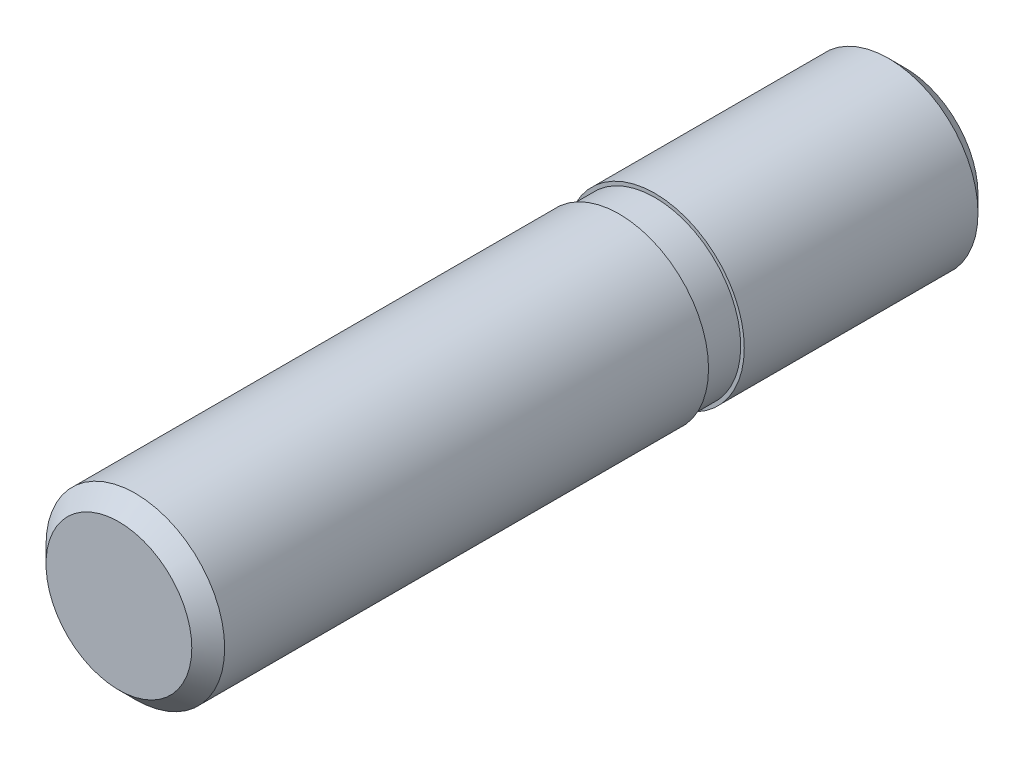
ISO-10303-21;
HEADER;
FILE_DESCRIPTION(('STEP AP214'),'2;1');
FILE_NAME('part.step','',(''),(''),'','','');
FILE_SCHEMA(('AUTOMOTIVE_DESIGN { 1 0 10303 214 1 1 1 1 }'));
ENDSEC;
DATA;
#1=APPLICATION_CONTEXT('core data for automotive mechanical design processes');
#2=APPLICATION_PROTOCOL_DEFINITION('international standard','automotive_design',2000,#1);
#3=PRODUCT_CONTEXT('',#1,'mechanical');
#4=PRODUCT('Part','Part','',(#3));
#5=PRODUCT_RELATED_PRODUCT_CATEGORY('part','',(#4));
#6=PRODUCT_DEFINITION_FORMATION('','',#4);
#7=PRODUCT_DEFINITION_CONTEXT('part definition',#1,'design');
#8=PRODUCT_DEFINITION('design','',#6,#7);
#9=PRODUCT_DEFINITION_SHAPE('','',#8);
#10=(LENGTH_UNIT() NAMED_UNIT(*) SI_UNIT(.MILLI.,.METRE.));
#11=(NAMED_UNIT(*) PLANE_ANGLE_UNIT() SI_UNIT($,.RADIAN.));
#12=(NAMED_UNIT(*) SI_UNIT($,.STERADIAN.) SOLID_ANGLE_UNIT());
#13=UNCERTAINTY_MEASURE_WITH_UNIT(LENGTH_MEASURE(1.E-05),#10,'distance_accuracy_value','');
#14=(GEOMETRIC_REPRESENTATION_CONTEXT(3) GLOBAL_UNCERTAINTY_ASSIGNED_CONTEXT((#13)) GLOBAL_UNIT_ASSIGNED_CONTEXT((#10,
#11,#12)) REPRESENTATION_CONTEXT('',''));
#15=CARTESIAN_POINT('',(0.,0.,0.));
#16=DIRECTION('',(0.,0.,1.));
#17=DIRECTION('',(1.,0.,0.));
#18=AXIS2_PLACEMENT_3D('',#15,#16,#17);
#19=CARTESIAN_POINT('',(0.,2.04,-14.));
#20=DIRECTION('',(0.,0.,-1.));
#21=DIRECTION('',(-1.,0.,0.));
#22=AXIS2_PLACEMENT_3D('',#19,#20,#21);
#23=PLANE('',#22);
#24=CARTESIAN_POINT('',(0.,0.,-14.));
#25=DIRECTION('',(0.,0.,1.));
#26=DIRECTION('',(1.,0.,0.));
#27=AXIS2_PLACEMENT_3D('',#24,#25,#26);
#28=CIRCLE('',#27,4.08000000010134);
#29=CARTESIAN_POINT('',(4.08000000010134,0.,-14.));
#30=VERTEX_POINT('',#29);
#31=EDGE_CURVE('E19',#30,#30,#28,.T.);
#32=ORIENTED_EDGE('',*,*,#31,.F.);
#33=EDGE_LOOP('',(#32));
#34=FACE_BOUND('',#33,.T.);
#35=ADVANCED_FACE('F12',(#34),#23,.T.);
#36=CARTESIAN_POINT('',(0.,0.,-13.080000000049));
#37=DIRECTION('',(0.,0.,1.));
#38=DIRECTION('',(1.,0.,0.));
#39=AXIS2_PLACEMENT_3D('',#36,#37,#38);
#40=CONICAL_SURFACE('',#39,5.0000000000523,0.785398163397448);
#41=CARTESIAN_POINT('',(0.,0.,-13.08));
#42=DIRECTION('',(0.,0.,1.));
#43=DIRECTION('',(1.,0.,0.));
#44=AXIS2_PLACEMENT_3D('',#41,#42,#43);
#45=CIRCLE('',#44,5.);
#46=CARTESIAN_POINT('',(5.,0.,-13.08));
#47=VERTEX_POINT('',#46);
#48=EDGE_CURVE('E23',#47,#47,#45,.T.);
#49=ORIENTED_EDGE('',*,*,#48,.F.);
#50=EDGE_LOOP('',(#49));
#51=FACE_BOUND('',#50,.T.);
#52=ORIENTED_EDGE('',*,*,#31,.T.);
#53=EDGE_LOOP('',(#52));
#54=FACE_BOUND('',#53,.T.);
#55=ADVANCED_FACE('F66',(#51,#54),#40,.T.);
#56=CARTESIAN_POINT('',(0.,0.,4.));
#57=DIRECTION('',(0.,0.,1.));
#58=DIRECTION('',(1.,0.,0.));
#59=AXIS2_PLACEMENT_3D('',#56,#57,#58);
#60=CYLINDRICAL_SURFACE('',#59,5.);
#61=CARTESIAN_POINT('',(0.,0.,0.));
#62=DIRECTION('',(0.,0.,1.));
#63=DIRECTION('',(1.,0.,0.));
#64=AXIS2_PLACEMENT_3D('',#61,#62,#63);
#65=CIRCLE('',#64,5.);
#66=CARTESIAN_POINT('',(5.,0.,0.));
#67=VERTEX_POINT('',#66);
#68=EDGE_CURVE('E28',#67,#67,#65,.T.);
#69=ORIENTED_EDGE('',*,*,#68,.F.);
#70=EDGE_LOOP('',(#69));
#71=FACE_BOUND('',#70,.T.);
#72=ORIENTED_EDGE('',*,*,#48,.T.);
#73=EDGE_LOOP('',(#72));
#74=FACE_BOUND('',#73,.T.);
#75=ADVANCED_FACE('F72',(#71,#74),#60,.T.);
#76=CARTESIAN_POINT('',(0.,0.,0.));
#77=DIRECTION('',(0.,0.,1.));
#78=DIRECTION('',(1.,0.,0.));
#79=AXIS2_PLACEMENT_3D('',#76,#77,#78);
#80=PLANE('',#79);
#81=CARTESIAN_POINT('',(0.,0.,0.));
#82=DIRECTION('',(0.,0.,1.));
#83=DIRECTION('',(1.,0.,0.));
#84=AXIS2_PLACEMENT_3D('',#81,#82,#83);
#85=CIRCLE('',#84,4.8);
#86=CARTESIAN_POINT('',(4.8,0.,0.));
#87=VERTEX_POINT('',#86);
#88=EDGE_CURVE('E8',#87,#87,#85,.T.);
#89=ORIENTED_EDGE('',*,*,#88,.F.);
#90=EDGE_LOOP('',(#89));
#91=FACE_BOUND('',#90,.T.);
#92=ORIENTED_EDGE('',*,*,#68,.T.);
#93=EDGE_LOOP('',(#92));
#94=FACE_BOUND('',#93,.T.);
#95=ADVANCED_FACE('F77',(#91,#94),#80,.T.);
#96=CARTESIAN_POINT('',(0.,0.,-2.95853014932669));
#97=DIRECTION('',(0.,0.,-1.));
#98=DIRECTION('',(-1.,0.,0.));
#99=AXIS2_PLACEMENT_3D('',#96,#97,#98);
#100=CYLINDRICAL_SURFACE('',#99,4.8);
#101=CARTESIAN_POINT('',(0.,0.,2.));
#102=DIRECTION('',(0.,0.,-1.));
#103=DIRECTION('',(-1.,0.,0.));
#104=AXIS2_PLACEMENT_3D('',#101,#102,#103);
#105=CIRCLE('',#104,4.8);
#106=CARTESIAN_POINT('',(-4.8,0.,2.));
#107=VERTEX_POINT('',#106);
#108=EDGE_CURVE('E44',#107,#107,#105,.T.);
#109=ORIENTED_EDGE('',*,*,#108,.T.);
#110=EDGE_LOOP('',(#109));
#111=FACE_BOUND('',#110,.T.);
#112=ORIENTED_EDGE('',*,*,#88,.T.);
#113=EDGE_LOOP('',(#112));
#114=FACE_BOUND('',#113,.T.);
#115=ADVANCED_FACE('F51',(#111,#114),#100,.T.);
#116=CARTESIAN_POINT('',(0.,0.,30.));
#117=DIRECTION('',(0.,0.,1.));
#118=DIRECTION('',(1.,0.,0.));
#119=AXIS2_PLACEMENT_3D('',#116,#117,#118);
#120=PLANE('',#119);
#121=CARTESIAN_POINT('',(0.,0.,30.));
#122=DIRECTION('',(0.,0.,1.));
#123=DIRECTION('',(1.,0.,0.));
#124=AXIS2_PLACEMENT_3D('',#121,#122,#123);
#125=CIRCLE('',#124,4.08);
#126=CARTESIAN_POINT('',(4.08,0.,30.));
#127=VERTEX_POINT('',#126);
#128=EDGE_CURVE('E40',#127,#127,#125,.T.);
#129=ORIENTED_EDGE('',*,*,#128,.T.);
#130=EDGE_LOOP('',(#129));
#131=FACE_BOUND('',#130,.T.);
#132=ADVANCED_FACE('F85',(#131),#120,.T.);
#133=CARTESIAN_POINT('',(0.,0.,30.));
#134=DIRECTION('',(0.,0.,-1.));
#135=DIRECTION('',(-1.,0.,0.));
#136=AXIS2_PLACEMENT_3D('',#133,#134,#135);
#137=CONICAL_SURFACE('',#136,4.08,0.78539816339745);
#138=CARTESIAN_POINT('',(0.,0.,29.08));
#139=DIRECTION('',(0.,0.,1.));
#140=DIRECTION('',(1.,0.,0.));
#141=AXIS2_PLACEMENT_3D('',#138,#139,#140);
#142=CIRCLE('',#141,5.);
#143=CARTESIAN_POINT('',(5.,0.,29.08));
#144=VERTEX_POINT('',#143);
#145=EDGE_CURVE('E31',#144,#144,#142,.F.);
#146=ORIENTED_EDGE('',*,*,#145,.F.);
#147=EDGE_LOOP('',(#146));
#148=FACE_BOUND('',#147,.T.);
#149=ORIENTED_EDGE('',*,*,#128,.F.);
#150=EDGE_LOOP('',(#149));
#151=FACE_BOUND('',#150,.T.);
#152=ADVANCED_FACE('F62',(#148,#151),#137,.T.);
#153=CARTESIAN_POINT('',(0.,0.,4.));
#154=DIRECTION('',(0.,0.,1.));
#155=DIRECTION('',(1.,0.,0.));
#156=AXIS2_PLACEMENT_3D('',#153,#154,#155);
#157=CYLINDRICAL_SURFACE('',#156,5.);
#158=CARTESIAN_POINT('',(0.,0.,2.));
#159=DIRECTION('',(0.,0.,1.));
#160=DIRECTION('',(1.,0.,0.));
#161=AXIS2_PLACEMENT_3D('',#158,#159,#160);
#162=CIRCLE('',#161,5.);
#163=CARTESIAN_POINT('',(5.,0.,2.));
#164=VERTEX_POINT('',#163);
#165=EDGE_CURVE('E35',#164,#164,#162,.T.);
#166=ORIENTED_EDGE('',*,*,#165,.T.);
#167=EDGE_LOOP('',(#166));
#168=FACE_BOUND('',#167,.T.);
#169=ORIENTED_EDGE('',*,*,#145,.T.);
#170=EDGE_LOOP('',(#169));
#171=FACE_BOUND('',#170,.T.);
#172=ADVANCED_FACE('F14',(#168,#171),#157,.T.);
#173=CARTESIAN_POINT('',(0.,0.,2.));
#174=DIRECTION('',(0.,0.,1.));
#175=DIRECTION('',(1.,0.,0.));
#176=AXIS2_PLACEMENT_3D('',#173,#174,#175);
#177=PLANE('',#176);
#178=ORIENTED_EDGE('',*,*,#108,.F.);
#179=EDGE_LOOP('',(#178));
#180=FACE_BOUND('',#179,.T.);
#181=ORIENTED_EDGE('',*,*,#165,.F.);
#182=EDGE_LOOP('',(#181));
#183=FACE_BOUND('',#182,.T.);
#184=ADVANCED_FACE('F53',(#180,#183),#177,.F.);
#185=CLOSED_SHELL('',(#35,#55,#75,#95,#115,#132,#152,#172,#184));
#186=MANIFOLD_SOLID_BREP('B1',#185);
#187=ADVANCED_BREP_SHAPE_REPRESENTATION('',(#18,#186),#14);
#188=SHAPE_DEFINITION_REPRESENTATION(#9,#187);
ENDSEC;
END-ISO-10303-21;
